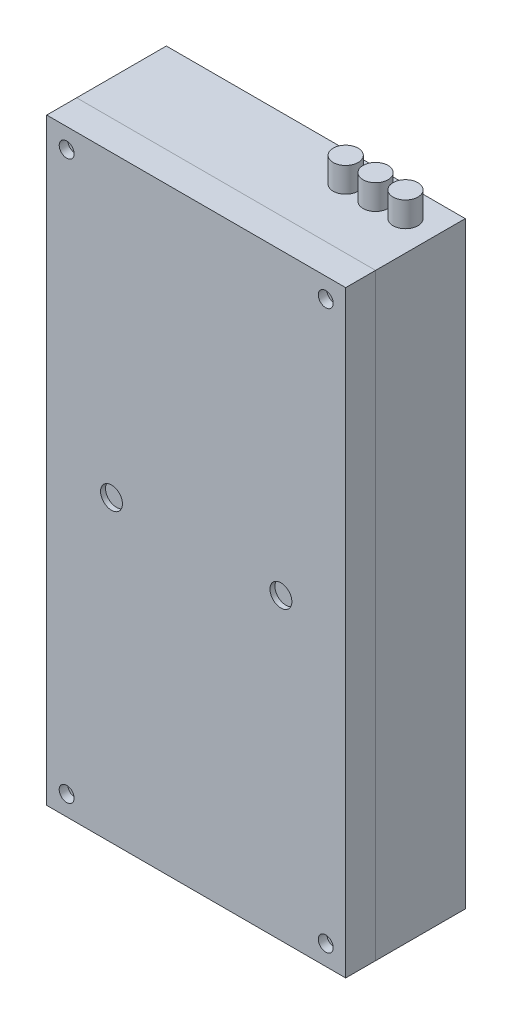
ISO-10303-21;
HEADER;
FILE_DESCRIPTION(('STEP AP214'),'2;1');
FILE_NAME('part.step','',(''),(''),'','','');
FILE_SCHEMA(('AUTOMOTIVE_DESIGN { 1 0 10303 214 1 1 1 1 }'));
ENDSEC;
DATA;
#1=APPLICATION_CONTEXT('core data for automotive mechanical design processes');
#2=APPLICATION_PROTOCOL_DEFINITION('international standard','automotive_design',2000,#1);
#3=PRODUCT_CONTEXT('',#1,'mechanical');
#4=PRODUCT('Part','Part','',(#3));
#5=PRODUCT_RELATED_PRODUCT_CATEGORY('part','',(#4));
#6=PRODUCT_DEFINITION_FORMATION('','',#4);
#7=PRODUCT_DEFINITION_CONTEXT('part definition',#1,'design');
#8=PRODUCT_DEFINITION('design','',#6,#7);
#9=PRODUCT_DEFINITION_SHAPE('','',#8);
#10=(LENGTH_UNIT() NAMED_UNIT(*) SI_UNIT(.MILLI.,.METRE.));
#11=(NAMED_UNIT(*) PLANE_ANGLE_UNIT() SI_UNIT($,.RADIAN.));
#12=(NAMED_UNIT(*) SI_UNIT($,.STERADIAN.) SOLID_ANGLE_UNIT());
#13=UNCERTAINTY_MEASURE_WITH_UNIT(LENGTH_MEASURE(1.E-05),#10,'distance_accuracy_value','');
#14=(GEOMETRIC_REPRESENTATION_CONTEXT(3) GLOBAL_UNCERTAINTY_ASSIGNED_CONTEXT((#13)) GLOBAL_UNIT_ASSIGNED_CONTEXT((#10,
#11,#12)) REPRESENTATION_CONTEXT('',''));
#15=CARTESIAN_POINT('',(0.,0.,0.));
#16=DIRECTION('',(0.,0.,1.));
#17=DIRECTION('',(1.,0.,0.));
#18=AXIS2_PLACEMENT_3D('',#15,#16,#17);
#19=CARTESIAN_POINT('',(90.,325.,30.));
#20=DIRECTION('',(0.,1.,0.));
#21=DIRECTION('',(0.,0.,1.));
#22=AXIS2_PLACEMENT_3D('',#19,#20,#21);
#23=PLANE('',#22);
#24=CARTESIAN_POINT('',(90.,325.,30.));
#25=DIRECTION('',(0.,-1.,0.));
#26=DIRECTION('',(0.,0.,-1.));
#27=AXIS2_PLACEMENT_3D('',#24,#25,#26);
#28=CIRCLE('',#27,12.5);
#29=CARTESIAN_POINT('',(90.,325.,17.5));
#30=VERTEX_POINT('',#29);
#31=EDGE_CURVE('P0_E19',#30,#30,#28,.T.);
#32=ORIENTED_EDGE('',*,*,#31,.F.);
#33=EDGE_LOOP('',(#32));
#34=FACE_BOUND('',#33,.T.);
#35=ADVANCED_FACE('P0_F16',(#34),#23,.T.);
#36=CARTESIAN_POINT('',(120.,325.,30.));
#37=DIRECTION('',(0.,1.,0.));
#38=DIRECTION('',(0.,0.,1.));
#39=AXIS2_PLACEMENT_3D('',#36,#37,#38);
#40=PLANE('',#39);
#41=CARTESIAN_POINT('',(120.,325.,30.));
#42=DIRECTION('',(0.,-1.,0.));
#43=DIRECTION('',(0.,0.,-1.));
#44=AXIS2_PLACEMENT_3D('',#41,#42,#43);
#45=CIRCLE('',#44,12.5);
#46=CARTESIAN_POINT('',(120.,325.,17.5));
#47=VERTEX_POINT('',#46);
#48=EDGE_CURVE('P0_E129',#47,#47,#45,.T.);
#49=ORIENTED_EDGE('',*,*,#48,.F.);
#50=EDGE_LOOP('',(#49));
#51=FACE_BOUND('',#50,.T.);
#52=ADVANCED_FACE('P0_F140',(#51),#40,.T.);
#53=CARTESIAN_POINT('',(60.,325.,30.));
#54=DIRECTION('',(0.,1.,0.));
#55=DIRECTION('',(0.,0.,1.));
#56=AXIS2_PLACEMENT_3D('',#53,#54,#55);
#57=PLANE('',#56);
#58=CARTESIAN_POINT('',(60.,325.,30.));
#59=DIRECTION('',(0.,-1.,0.));
#60=DIRECTION('',(0.,0.,-1.));
#61=AXIS2_PLACEMENT_3D('',#58,#59,#60);
#62=CIRCLE('',#61,12.5);
#63=CARTESIAN_POINT('',(60.,325.,17.5));
#64=VERTEX_POINT('',#63);
#65=EDGE_CURVE('P0_E121',#64,#64,#62,.T.);
#66=ORIENTED_EDGE('',*,*,#65,.F.);
#67=EDGE_LOOP('',(#66));
#68=FACE_BOUND('',#67,.T.);
#69=ADVANCED_FACE('P0_F145',(#68),#57,.T.);
#70=CARTESIAN_POINT('',(90.,325.,30.));
#71=DIRECTION('',(0.,-1.,0.));
#72=DIRECTION('',(0.,0.,-1.));
#73=AXIS2_PLACEMENT_3D('',#70,#71,#72);
#74=CYLINDRICAL_SURFACE('',#73,12.5);
#75=ORIENTED_EDGE('',*,*,#31,.T.);
#76=EDGE_LOOP('',(#75));
#77=FACE_BOUND('',#76,.T.);
#78=CARTESIAN_POINT('',(90.,300.,30.));
#79=DIRECTION('',(0.,-1.,0.));
#80=DIRECTION('',(0.,0.,-1.));
#81=AXIS2_PLACEMENT_3D('',#78,#79,#80);
#82=CIRCLE('',#81,12.5);
#83=CARTESIAN_POINT('',(90.,300.,17.5));
#84=VERTEX_POINT('',#83);
#85=EDGE_CURVE('P0_E102',#84,#84,#82,.F.);
#86=ORIENTED_EDGE('',*,*,#85,.T.);
#87=EDGE_LOOP('',(#86));
#88=FACE_BOUND('',#87,.T.);
#89=ADVANCED_FACE('P0_F136',(#77,#88),#74,.T.);
#90=CARTESIAN_POINT('',(120.,325.,30.));
#91=DIRECTION('',(0.,-1.,0.));
#92=DIRECTION('',(0.,0.,-1.));
#93=AXIS2_PLACEMENT_3D('',#90,#91,#92);
#94=CYLINDRICAL_SURFACE('',#93,12.5);
#95=ORIENTED_EDGE('',*,*,#48,.T.);
#96=EDGE_LOOP('',(#95));
#97=FACE_BOUND('',#96,.T.);
#98=CARTESIAN_POINT('',(120.,300.,30.));
#99=DIRECTION('',(0.,-1.,0.));
#100=DIRECTION('',(0.,0.,-1.));
#101=AXIS2_PLACEMENT_3D('',#98,#99,#100);
#102=CIRCLE('',#101,12.5);
#103=CARTESIAN_POINT('',(120.,300.,17.5));
#104=VERTEX_POINT('',#103);
#105=EDGE_CURVE('P0_E114',#104,#104,#102,.F.);
#106=ORIENTED_EDGE('',*,*,#105,.T.);
#107=EDGE_LOOP('',(#106));
#108=FACE_BOUND('',#107,.T.);
#109=ADVANCED_FACE('P0_F187',(#97,#108),#94,.T.);
#110=CARTESIAN_POINT('',(60.,325.,30.));
#111=DIRECTION('',(0.,-1.,0.));
#112=DIRECTION('',(0.,0.,-1.));
#113=AXIS2_PLACEMENT_3D('',#110,#111,#112);
#114=CYLINDRICAL_SURFACE('',#113,12.5);
#115=ORIENTED_EDGE('',*,*,#65,.T.);
#116=EDGE_LOOP('',(#115));
#117=FACE_BOUND('',#116,.T.);
#118=CARTESIAN_POINT('',(60.,300.,30.));
#119=DIRECTION('',(0.,-1.,0.));
#120=DIRECTION('',(0.,0.,-1.));
#121=AXIS2_PLACEMENT_3D('',#118,#119,#120);
#122=CIRCLE('',#121,12.5);
#123=CARTESIAN_POINT('',(60.,300.,17.5));
#124=VERTEX_POINT('',#123);
#125=EDGE_CURVE('P0_E92',#124,#124,#122,.F.);
#126=ORIENTED_EDGE('',*,*,#125,.T.);
#127=EDGE_LOOP('',(#126));
#128=FACE_BOUND('',#127,.T.);
#129=ADVANCED_FACE('P0_F183',(#117,#128),#114,.T.);
#130=CARTESIAN_POINT('',(-142.,292.,110.));
#131=DIRECTION('',(-1.,0.,0.));
#132=DIRECTION('',(0.,-1.,0.));
#133=AXIS2_PLACEMENT_3D('',#130,#131,#132);
#134=PLANE('',#133);
#135=DIRECTION('',(0.,0.,-1.));
#136=VECTOR('',#135,1.);
#137=CARTESIAN_POINT('',(-142.,-292.,110.));
#138=LINE('',#137,#136);
#139=CARTESIAN_POINT('',(-142.,-292.,90.));
#140=VERTEX_POINT('',#139);
#141=CARTESIAN_POINT('',(-142.,-292.,0.));
#142=VERTEX_POINT('',#141);
#143=EDGE_CURVE('P0_E103',#140,#142,#138,.T.);
#144=ORIENTED_EDGE('',*,*,#143,.T.);
#145=DIRECTION('',(0.,1.,0.));
#146=VECTOR('',#145,1.);
#147=CARTESIAN_POINT('',(-142.,-300.,0.));
#148=LINE('',#147,#146);
#149=CARTESIAN_POINT('',(-142.,292.,0.));
#150=VERTEX_POINT('',#149);
#151=EDGE_CURVE('P0_E229',#142,#150,#148,.T.);
#152=ORIENTED_EDGE('',*,*,#151,.T.);
#153=DIRECTION('',(0.,0.,1.));
#154=VECTOR('',#153,1.);
#155=CARTESIAN_POINT('',(-142.,292.,110.));
#156=LINE('',#155,#154);
#157=CARTESIAN_POINT('',(-142.,292.,90.));
#158=VERTEX_POINT('',#157);
#159=EDGE_CURVE('P0_E118',#150,#158,#156,.T.);
#160=ORIENTED_EDGE('',*,*,#159,.T.);
#161=DIRECTION('',(0.,1.,0.));
#162=VECTOR('',#161,1.);
#163=CARTESIAN_POINT('',(-142.,-300.,90.));
#164=LINE('',#163,#162);
#165=EDGE_CURVE('P0_E107',#140,#158,#164,.T.);
#166=ORIENTED_EDGE('',*,*,#165,.F.);
#167=EDGE_LOOP('',(#144,#152,#160,#166));
#168=FACE_BOUND('',#167,.T.);
#169=ADVANCED_FACE('P0_F180',(#168),#134,.F.);
#170=CARTESIAN_POINT('',(142.,292.,110.));
#171=DIRECTION('',(0.,1.,0.));
#172=DIRECTION('',(0.,0.,1.));
#173=AXIS2_PLACEMENT_3D('',#170,#171,#172);
#174=PLANE('',#173);
#175=ORIENTED_EDGE('',*,*,#159,.F.);
#176=DIRECTION('',(1.,0.,0.));
#177=VECTOR('',#176,1.);
#178=CARTESIAN_POINT('',(-150.,292.,0.));
#179=LINE('',#178,#177);
#180=CARTESIAN_POINT('',(142.,292.,0.));
#181=VERTEX_POINT('',#180);
#182=EDGE_CURVE('P0_E227',#150,#181,#179,.T.);
#183=ORIENTED_EDGE('',*,*,#182,.T.);
#184=DIRECTION('',(0.,0.,1.));
#185=VECTOR('',#184,1.);
#186=CARTESIAN_POINT('',(142.,292.,110.));
#187=LINE('',#186,#185);
#188=CARTESIAN_POINT('',(142.,292.,90.));
#189=VERTEX_POINT('',#188);
#190=EDGE_CURVE('P0_E78',#181,#189,#187,.T.);
#191=ORIENTED_EDGE('',*,*,#190,.T.);
#192=DIRECTION('',(1.,0.,0.));
#193=VECTOR('',#192,1.);
#194=CARTESIAN_POINT('',(-150.,292.,90.));
#195=LINE('',#194,#193);
#196=EDGE_CURVE('P0_E90',#158,#189,#195,.T.);
#197=ORIENTED_EDGE('',*,*,#196,.F.);
#198=EDGE_LOOP('',(#175,#183,#191,#197));
#199=FACE_BOUND('',#198,.T.);
#200=ADVANCED_FACE('P0_F177',(#199),#174,.F.);
#201=CARTESIAN_POINT('',(142.,292.,110.));
#202=DIRECTION('',(1.,0.,0.));
#203=DIRECTION('',(0.,1.,0.));
#204=AXIS2_PLACEMENT_3D('',#201,#202,#203);
#205=PLANE('',#204);
#206=ORIENTED_EDGE('',*,*,#190,.F.);
#207=DIRECTION('',(0.,1.,0.));
#208=VECTOR('',#207,1.);
#209=CARTESIAN_POINT('',(142.,-300.,0.));
#210=LINE('',#209,#208);
#211=CARTESIAN_POINT('',(142.,-292.,0.));
#212=VERTEX_POINT('',#211);
#213=EDGE_CURVE('P0_E98',#181,#212,#210,.F.);
#214=ORIENTED_EDGE('',*,*,#213,.T.);
#215=DIRECTION('',(0.,0.,-1.));
#216=VECTOR('',#215,1.);
#217=CARTESIAN_POINT('',(142.,-292.,110.));
#218=LINE('',#217,#216);
#219=CARTESIAN_POINT('',(142.,-292.,90.));
#220=VERTEX_POINT('',#219);
#221=EDGE_CURVE('P0_E95',#212,#220,#218,.F.);
#222=ORIENTED_EDGE('',*,*,#221,.T.);
#223=DIRECTION('',(0.,1.,0.));
#224=VECTOR('',#223,1.);
#225=CARTESIAN_POINT('',(142.,-300.,90.));
#226=LINE('',#225,#224);
#227=EDGE_CURVE('P0_E84',#189,#220,#226,.F.);
#228=ORIENTED_EDGE('',*,*,#227,.F.);
#229=EDGE_LOOP('',(#206,#214,#222,#228));
#230=FACE_BOUND('',#229,.T.);
#231=ADVANCED_FACE('P0_F96',(#230),#205,.F.);
#232=CARTESIAN_POINT('',(142.,-292.,110.));
#233=DIRECTION('',(0.,-1.,0.));
#234=DIRECTION('',(0.,0.,-1.));
#235=AXIS2_PLACEMENT_3D('',#232,#233,#234);
#236=PLANE('',#235);
#237=ORIENTED_EDGE('',*,*,#221,.F.);
#238=DIRECTION('',(1.,0.,0.));
#239=VECTOR('',#238,1.);
#240=CARTESIAN_POINT('',(-150.,-292.,0.));
#241=LINE('',#240,#239);
#242=EDGE_CURVE('P0_E224',#212,#142,#241,.F.);
#243=ORIENTED_EDGE('',*,*,#242,.T.);
#244=ORIENTED_EDGE('',*,*,#143,.F.);
#245=DIRECTION('',(1.,0.,0.));
#246=VECTOR('',#245,1.);
#247=CARTESIAN_POINT('',(-150.,-292.,90.));
#248=LINE('',#247,#246);
#249=EDGE_CURVE('P0_E88',#220,#140,#248,.F.);
#250=ORIENTED_EDGE('',*,*,#249,.F.);
#251=EDGE_LOOP('',(#237,#243,#244,#250));
#252=FACE_BOUND('',#251,.T.);
#253=ADVANCED_FACE('P0_F105',(#252),#236,.F.);
#254=CARTESIAN_POINT('',(150.,300.,90.));
#255=DIRECTION('',(-1.,0.,0.));
#256=DIRECTION('',(0.,-1.,0.));
#257=AXIS2_PLACEMENT_3D('',#254,#255,#256);
#258=PLANE('',#257);
#259=DIRECTION('',(0.,0.,-1.));
#260=VECTOR('',#259,1.);
#261=CARTESIAN_POINT('',(150.,300.,90.));
#262=LINE('',#261,#260);
#263=CARTESIAN_POINT('',(150.,300.,0.));
#264=VERTEX_POINT('',#263);
#265=CARTESIAN_POINT('',(150.,300.,90.));
#266=VERTEX_POINT('',#265);
#267=EDGE_CURVE('P0_E112',#264,#266,#262,.F.);
#268=ORIENTED_EDGE('',*,*,#267,.T.);
#269=DIRECTION('',(0.,1.,0.));
#270=VECTOR('',#269,1.);
#271=CARTESIAN_POINT('',(150.,-300.,90.));
#272=LINE('',#271,#270);
#273=CARTESIAN_POINT('',(150.,-300.,90.));
#274=VERTEX_POINT('',#273);
#275=EDGE_CURVE('P0_E238',#274,#266,#272,.T.);
#276=ORIENTED_EDGE('',*,*,#275,.F.);
#277=DIRECTION('',(0.,0.,1.));
#278=VECTOR('',#277,1.);
#279=CARTESIAN_POINT('',(150.,-300.,90.));
#280=LINE('',#279,#278);
#281=CARTESIAN_POINT('',(150.,-300.,0.));
#282=VERTEX_POINT('',#281);
#283=EDGE_CURVE('P0_E232',#274,#282,#280,.F.);
#284=ORIENTED_EDGE('',*,*,#283,.T.);
#285=DIRECTION('',(0.,1.,0.));
#286=VECTOR('',#285,1.);
#287=CARTESIAN_POINT('',(150.,-300.,0.));
#288=LINE('',#287,#286);
#289=EDGE_CURVE('P0_E217',#282,#264,#288,.T.);
#290=ORIENTED_EDGE('',*,*,#289,.T.);
#291=EDGE_LOOP('',(#268,#276,#284,#290));
#292=FACE_BOUND('',#291,.T.);
#293=ADVANCED_FACE('P0_F168',(#292),#258,.F.);
#294=CARTESIAN_POINT('',(-150.,300.,90.));
#295=DIRECTION('',(0.,-1.,0.));
#296=DIRECTION('',(0.,0.,-1.));
#297=AXIS2_PLACEMENT_3D('',#294,#295,#296);
#298=PLANE('',#297);
#299=ORIENTED_EDGE('',*,*,#125,.F.);
#300=EDGE_LOOP('',(#299));
#301=FACE_BOUND('',#300,.T.);
#302=ORIENTED_EDGE('',*,*,#105,.F.);
#303=EDGE_LOOP('',(#302));
#304=FACE_BOUND('',#303,.T.);
#305=DIRECTION('',(0.,0.,1.));
#306=VECTOR('',#305,1.);
#307=CARTESIAN_POINT('',(-150.,300.,90.));
#308=LINE('',#307,#306);
#309=CARTESIAN_POINT('',(-150.,300.,0.));
#310=VERTEX_POINT('',#309);
#311=CARTESIAN_POINT('',(-150.,300.,90.));
#312=VERTEX_POINT('',#311);
#313=EDGE_CURVE('P0_E207',#310,#312,#308,.T.);
#314=ORIENTED_EDGE('',*,*,#313,.T.);
#315=DIRECTION('',(1.,0.,0.));
#316=VECTOR('',#315,1.);
#317=CARTESIAN_POINT('',(-150.,300.,90.));
#318=LINE('',#317,#316);
#319=EDGE_CURVE('P0_E209',#266,#312,#318,.F.);
#320=ORIENTED_EDGE('',*,*,#319,.F.);
#321=ORIENTED_EDGE('',*,*,#267,.F.);
#322=DIRECTION('',(1.,0.,0.));
#323=VECTOR('',#322,1.);
#324=CARTESIAN_POINT('',(-150.,300.,0.));
#325=LINE('',#324,#323);
#326=EDGE_CURVE('P0_E211',#264,#310,#325,.F.);
#327=ORIENTED_EDGE('',*,*,#326,.T.);
#328=EDGE_LOOP('',(#314,#320,#321,#327));
#329=FACE_BOUND('',#328,.T.);
#330=ORIENTED_EDGE('',*,*,#85,.F.);
#331=EDGE_LOOP('',(#330));
#332=FACE_BOUND('',#331,.T.);
#333=ADVANCED_FACE('P0_F164',(#301,#304,#329,#332),#298,.F.);
#334=CARTESIAN_POINT('',(-150.,-300.,90.));
#335=DIRECTION('',(0.,0.,1.));
#336=DIRECTION('',(1.,0.,0.));
#337=AXIS2_PLACEMENT_3D('',#334,#335,#336);
#338=PLANE('',#337);
#339=ORIENTED_EDGE('',*,*,#275,.T.);
#340=ORIENTED_EDGE('',*,*,#319,.T.);
#341=DIRECTION('',(0.,1.,0.));
#342=VECTOR('',#341,1.);
#343=CARTESIAN_POINT('',(-150.,300.,90.));
#344=LINE('',#343,#342);
#345=CARTESIAN_POINT('',(-150.,-300.,90.));
#346=VERTEX_POINT('',#345);
#347=EDGE_CURVE('P0_E213',#312,#346,#344,.F.);
#348=ORIENTED_EDGE('',*,*,#347,.T.);
#349=DIRECTION('',(1.,0.,0.));
#350=VECTOR('',#349,1.);
#351=CARTESIAN_POINT('',(-150.,-300.,90.));
#352=LINE('',#351,#350);
#353=EDGE_CURVE('P0_E234',#346,#274,#352,.T.);
#354=ORIENTED_EDGE('',*,*,#353,.T.);
#355=EDGE_LOOP('',(#339,#340,#348,#354));
#356=FACE_BOUND('',#355,.T.);
#357=ORIENTED_EDGE('',*,*,#165,.T.);
#358=ORIENTED_EDGE('',*,*,#196,.T.);
#359=ORIENTED_EDGE('',*,*,#227,.T.);
#360=ORIENTED_EDGE('',*,*,#249,.T.);
#361=EDGE_LOOP('',(#357,#358,#359,#360));
#362=FACE_BOUND('',#361,.T.);
#363=ADVANCED_FACE('P0_F86',(#356,#362),#338,.T.);
#364=CARTESIAN_POINT('',(-150.,-300.,90.));
#365=DIRECTION('',(0.,1.,0.));
#366=DIRECTION('',(0.,0.,1.));
#367=AXIS2_PLACEMENT_3D('',#364,#365,#366);
#368=PLANE('',#367);
#369=ORIENTED_EDGE('',*,*,#283,.F.);
#370=ORIENTED_EDGE('',*,*,#353,.F.);
#371=DIRECTION('',(0.,0.,1.));
#372=VECTOR('',#371,1.);
#373=CARTESIAN_POINT('',(-150.,-300.,90.));
#374=LINE('',#373,#372);
#375=CARTESIAN_POINT('',(-150.,-300.,0.));
#376=VERTEX_POINT('',#375);
#377=EDGE_CURVE('P0_E25',#346,#376,#374,.F.);
#378=ORIENTED_EDGE('',*,*,#377,.T.);
#379=DIRECTION('',(1.,0.,0.));
#380=VECTOR('',#379,1.);
#381=CARTESIAN_POINT('',(-150.,-300.,0.));
#382=LINE('',#381,#380);
#383=EDGE_CURVE('P0_E33',#376,#282,#382,.T.);
#384=ORIENTED_EDGE('',*,*,#383,.T.);
#385=EDGE_LOOP('',(#369,#370,#378,#384));
#386=FACE_BOUND('',#385,.T.);
#387=ADVANCED_FACE('P0_F155',(#386),#368,.F.);
#388=CARTESIAN_POINT('',(-150.,-300.,0.));
#389=DIRECTION('',(0.,0.,1.));
#390=DIRECTION('',(1.,0.,0.));
#391=AXIS2_PLACEMENT_3D('',#388,#389,#390);
#392=PLANE('',#391);
#393=ORIENTED_EDGE('',*,*,#326,.F.);
#394=ORIENTED_EDGE('',*,*,#289,.F.);
#395=ORIENTED_EDGE('',*,*,#383,.F.);
#396=DIRECTION('',(0.,1.,0.));
#397=VECTOR('',#396,1.);
#398=CARTESIAN_POINT('',(-150.,300.,0.));
#399=LINE('',#398,#397);
#400=EDGE_CURVE('P0_E11',#376,#310,#399,.T.);
#401=ORIENTED_EDGE('',*,*,#400,.T.);
#402=EDGE_LOOP('',(#393,#394,#395,#401));
#403=FACE_BOUND('',#402,.T.);
#404=ORIENTED_EDGE('',*,*,#213,.F.);
#405=ORIENTED_EDGE('',*,*,#182,.F.);
#406=ORIENTED_EDGE('',*,*,#151,.F.);
#407=ORIENTED_EDGE('',*,*,#242,.F.);
#408=EDGE_LOOP('',(#404,#405,#406,#407));
#409=FACE_BOUND('',#408,.T.);
#410=ADVANCED_FACE('P0_F149',(#403,#409),#392,.F.);
#411=CARTESIAN_POINT('',(-150.,300.,90.));
#412=DIRECTION('',(1.,0.,0.));
#413=DIRECTION('',(0.,1.,0.));
#414=AXIS2_PLACEMENT_3D('',#411,#412,#413);
#415=PLANE('',#414);
#416=ORIENTED_EDGE('',*,*,#377,.F.);
#417=ORIENTED_EDGE('',*,*,#347,.F.);
#418=ORIENTED_EDGE('',*,*,#313,.F.);
#419=ORIENTED_EDGE('',*,*,#400,.F.);
#420=EDGE_LOOP('',(#416,#417,#418,#419));
#421=FACE_BOUND('',#420,.T.);
#422=ADVANCED_FACE('P0_F147',(#421),#415,.F.);
#423=CLOSED_SHELL('',(#35,#52,#69,#89,#109,#129,#169,#200,#231,#253,#293,#333,#363,#387,#410,#422));
#424=MANIFOLD_SOLID_BREP('P0_B1',#423);
#425=CARTESIAN_POINT('',(142.,-292.,110.));
#426=DIRECTION('',(0.,0.,-1.));
#427=DIRECTION('',(-1.,0.,0.));
#428=AXIS2_PLACEMENT_3D('',#425,#426,#427);
#429=PLANE('',#428);
#430=CARTESIAN_POINT('',(130.,-280.,110.));
#431=DIRECTION('',(0.,0.,1.));
#432=DIRECTION('',(1.,0.,0.));
#433=AXIS2_PLACEMENT_3D('',#430,#431,#432);
#434=CIRCLE('',#433,4.5);
#435=CARTESIAN_POINT('',(134.5,-280.,110.));
#436=VERTEX_POINT('',#435);
#437=EDGE_CURVE('P1_E89',#436,#436,#434,.T.);
#438=ORIENTED_EDGE('',*,*,#437,.T.);
#439=EDGE_LOOP('',(#438));
#440=FACE_BOUND('',#439,.T.);
#441=CARTESIAN_POINT('',(-130.,280.,110.));
#442=DIRECTION('',(0.,0.,1.));
#443=DIRECTION('',(1.,0.,0.));
#444=AXIS2_PLACEMENT_3D('',#441,#442,#443);
#445=CIRCLE('',#444,4.5);
#446=CARTESIAN_POINT('',(-125.5,280.,110.));
#447=VERTEX_POINT('',#446);
#448=EDGE_CURVE('P1_E164',#447,#447,#445,.T.);
#449=ORIENTED_EDGE('',*,*,#448,.T.);
#450=EDGE_LOOP('',(#449));
#451=FACE_BOUND('',#450,.T.);
#452=DIRECTION('',(0.,-1.,0.));
#453=VECTOR('',#452,1.);
#454=CARTESIAN_POINT('',(-142.,292.,110.));
#455=LINE('',#454,#453);
#456=CARTESIAN_POINT('',(-142.,-292.,110.));
#457=VERTEX_POINT('',#456);
#458=CARTESIAN_POINT('',(-142.,292.,110.));
#459=VERTEX_POINT('',#458);
#460=EDGE_CURVE('P1_E81',#457,#459,#455,.F.);
#461=ORIENTED_EDGE('',*,*,#460,.T.);
#462=DIRECTION('',(1.,0.,0.));
#463=VECTOR('',#462,1.);
#464=CARTESIAN_POINT('',(142.,292.,110.));
#465=LINE('',#464,#463);
#466=CARTESIAN_POINT('',(142.,292.,110.));
#467=VERTEX_POINT('',#466);
#468=EDGE_CURVE('P1_E78',#459,#467,#465,.T.);
#469=ORIENTED_EDGE('',*,*,#468,.T.);
#470=DIRECTION('',(0.,1.,0.));
#471=VECTOR('',#470,1.);
#472=CARTESIAN_POINT('',(142.,292.,110.));
#473=LINE('',#472,#471);
#474=CARTESIAN_POINT('',(142.,-292.,110.));
#475=VERTEX_POINT('',#474);
#476=EDGE_CURVE('P1_E103',#467,#475,#473,.F.);
#477=ORIENTED_EDGE('',*,*,#476,.T.);
#478=DIRECTION('',(1.,0.,0.));
#479=VECTOR('',#478,1.);
#480=CARTESIAN_POINT('',(142.,-292.,110.));
#481=LINE('',#480,#479);
#482=EDGE_CURVE('P1_E85',#475,#457,#481,.F.);
#483=ORIENTED_EDGE('',*,*,#482,.T.);
#484=EDGE_LOOP('',(#461,#469,#477,#483));
#485=FACE_BOUND('',#484,.T.);
#486=CARTESIAN_POINT('',(130.,280.,110.));
#487=DIRECTION('',(0.,0.,1.));
#488=DIRECTION('',(1.,0.,0.));
#489=AXIS2_PLACEMENT_3D('',#486,#487,#488);
#490=CIRCLE('',#489,4.5);
#491=CARTESIAN_POINT('',(134.5,280.,110.));
#492=VERTEX_POINT('',#491);
#493=EDGE_CURVE('P1_E19',#492,#492,#490,.T.);
#494=ORIENTED_EDGE('',*,*,#493,.T.);
#495=EDGE_LOOP('',(#494));
#496=FACE_BOUND('',#495,.T.);
#497=CARTESIAN_POINT('',(-130.,-280.,110.));
#498=DIRECTION('',(0.,0.,1.));
#499=DIRECTION('',(1.,0.,0.));
#500=AXIS2_PLACEMENT_3D('',#497,#498,#499);
#501=CIRCLE('',#500,4.5);
#502=CARTESIAN_POINT('',(-125.5,-280.,110.));
#503=VERTEX_POINT('',#502);
#504=EDGE_CURVE('P1_E162',#503,#503,#501,.T.);
#505=ORIENTED_EDGE('',*,*,#504,.T.);
#506=EDGE_LOOP('',(#505));
#507=FACE_BOUND('',#506,.T.);
#508=ADVANCED_FACE('P1_F16',(#440,#451,#485,#496,#507),#429,.T.);
#509=CARTESIAN_POINT('',(130.,280.,120.));
#510=DIRECTION('',(0.,0.,1.));
#511=DIRECTION('',(1.,0.,0.));
#512=AXIS2_PLACEMENT_3D('',#509,#510,#511);
#513=CYLINDRICAL_SURFACE('',#512,4.5);
#514=ORIENTED_EDGE('',*,*,#493,.F.);
#515=EDGE_LOOP('',(#514));
#516=FACE_BOUND('',#515,.T.);
#517=CARTESIAN_POINT('',(130.,280.,111.4));
#518=DIRECTION('',(0.,0.,1.));
#519=DIRECTION('',(1.,0.,0.));
#520=AXIS2_PLACEMENT_3D('',#517,#518,#519);
#521=CIRCLE('',#520,4.5);
#522=CARTESIAN_POINT('',(134.5,280.,111.4));
#523=VERTEX_POINT('',#522);
#524=EDGE_CURVE('P1_E156',#523,#523,#521,.T.);
#525=ORIENTED_EDGE('',*,*,#524,.T.);
#526=EDGE_LOOP('',(#525));
#527=FACE_BOUND('',#526,.T.);
#528=ADVANCED_FACE('P1_F172',(#516,#527),#513,.F.);
#529=CARTESIAN_POINT('',(-130.,280.,120.));
#530=DIRECTION('',(0.,0.,1.));
#531=DIRECTION('',(1.,0.,0.));
#532=AXIS2_PLACEMENT_3D('',#529,#530,#531);
#533=CYLINDRICAL_SURFACE('',#532,4.5);
#534=ORIENTED_EDGE('',*,*,#448,.F.);
#535=EDGE_LOOP('',(#534));
#536=FACE_BOUND('',#535,.T.);
#537=CARTESIAN_POINT('',(-130.,280.,111.4));
#538=DIRECTION('',(0.,0.,1.));
#539=DIRECTION('',(1.,0.,0.));
#540=AXIS2_PLACEMENT_3D('',#537,#538,#539);
#541=CIRCLE('',#540,4.5);
#542=CARTESIAN_POINT('',(-125.5,280.,111.4));
#543=VERTEX_POINT('',#542);
#544=EDGE_CURVE('P1_E153',#543,#543,#541,.T.);
#545=ORIENTED_EDGE('',*,*,#544,.T.);
#546=EDGE_LOOP('',(#545));
#547=FACE_BOUND('',#546,.T.);
#548=ADVANCED_FACE('P1_F175',(#536,#547),#533,.F.);
#549=CARTESIAN_POINT('',(-130.,-280.,120.));
#550=DIRECTION('',(0.,0.,1.));
#551=DIRECTION('',(1.,0.,0.));
#552=AXIS2_PLACEMENT_3D('',#549,#550,#551);
#553=CYLINDRICAL_SURFACE('',#552,4.5);
#554=ORIENTED_EDGE('',*,*,#504,.F.);
#555=EDGE_LOOP('',(#554));
#556=FACE_BOUND('',#555,.T.);
#557=CARTESIAN_POINT('',(-130.,-280.,111.4));
#558=DIRECTION('',(0.,0.,1.));
#559=DIRECTION('',(1.,0.,0.));
#560=AXIS2_PLACEMENT_3D('',#557,#558,#559);
#561=CIRCLE('',#560,4.5);
#562=CARTESIAN_POINT('',(-125.5,-280.,111.4));
#563=VERTEX_POINT('',#562);
#564=EDGE_CURVE('P1_E150',#563,#563,#561,.T.);
#565=ORIENTED_EDGE('',*,*,#564,.T.);
#566=EDGE_LOOP('',(#565));
#567=FACE_BOUND('',#566,.T.);
#568=ADVANCED_FACE('P1_F259',(#556,#567),#553,.F.);
#569=CARTESIAN_POINT('',(130.,-280.,120.));
#570=DIRECTION('',(0.,0.,1.));
#571=DIRECTION('',(1.,0.,0.));
#572=AXIS2_PLACEMENT_3D('',#569,#570,#571);
#573=CYLINDRICAL_SURFACE('',#572,4.5);
#574=ORIENTED_EDGE('',*,*,#437,.F.);
#575=EDGE_LOOP('',(#574));
#576=FACE_BOUND('',#575,.T.);
#577=CARTESIAN_POINT('',(130.,-280.,111.4));
#578=DIRECTION('',(0.,0.,1.));
#579=DIRECTION('',(1.,0.,0.));
#580=AXIS2_PLACEMENT_3D('',#577,#578,#579);
#581=CIRCLE('',#580,4.5);
#582=CARTESIAN_POINT('',(134.5,-280.,111.4));
#583=VERTEX_POINT('',#582);
#584=EDGE_CURVE('P1_E147',#583,#583,#581,.T.);
#585=ORIENTED_EDGE('',*,*,#584,.T.);
#586=EDGE_LOOP('',(#585));
#587=FACE_BOUND('',#586,.T.);
#588=ADVANCED_FACE('P1_F261',(#576,#587),#573,.F.);
#589=CARTESIAN_POINT('',(-142.,292.,110.));
#590=DIRECTION('',(-1.,0.,0.));
#591=DIRECTION('',(0.,-1.,0.));
#592=AXIS2_PLACEMENT_3D('',#589,#590,#591);
#593=PLANE('',#592);
#594=ORIENTED_EDGE('',*,*,#460,.F.);
#595=DIRECTION('',(0.,0.,-1.));
#596=VECTOR('',#595,1.);
#597=CARTESIAN_POINT('',(-142.,-292.,110.));
#598=LINE('',#597,#596);
#599=CARTESIAN_POINT('',(-142.,-292.,90.));
#600=VERTEX_POINT('',#599);
#601=EDGE_CURVE('P1_E159',#457,#600,#598,.T.);
#602=ORIENTED_EDGE('',*,*,#601,.T.);
#603=DIRECTION('',(0.,1.,0.));
#604=VECTOR('',#603,1.);
#605=CARTESIAN_POINT('',(-142.,-300.,90.));
#606=LINE('',#605,#604);
#607=CARTESIAN_POINT('',(-142.,292.,90.));
#608=VERTEX_POINT('',#607);
#609=EDGE_CURVE('P1_E94',#600,#608,#606,.T.);
#610=ORIENTED_EDGE('',*,*,#609,.T.);
#611=DIRECTION('',(0.,0.,1.));
#612=VECTOR('',#611,1.);
#613=CARTESIAN_POINT('',(-142.,292.,110.));
#614=LINE('',#613,#612);
#615=EDGE_CURVE('P1_E88',#608,#459,#614,.T.);
#616=ORIENTED_EDGE('',*,*,#615,.T.);
#617=EDGE_LOOP('',(#594,#602,#610,#616));
#618=FACE_BOUND('',#617,.T.);
#619=ADVANCED_FACE('P1_F92',(#618),#593,.F.);
#620=CARTESIAN_POINT('',(142.,292.,110.));
#621=DIRECTION('',(0.,1.,0.));
#622=DIRECTION('',(0.,0.,1.));
#623=AXIS2_PLACEMENT_3D('',#620,#621,#622);
#624=PLANE('',#623);
#625=ORIENTED_EDGE('',*,*,#468,.F.);
#626=ORIENTED_EDGE('',*,*,#615,.F.);
#627=DIRECTION('',(1.,0.,0.));
#628=VECTOR('',#627,1.);
#629=CARTESIAN_POINT('',(-150.,292.,90.));
#630=LINE('',#629,#628);
#631=CARTESIAN_POINT('',(142.,292.,90.));
#632=VERTEX_POINT('',#631);
#633=EDGE_CURVE('P1_E469',#608,#632,#630,.T.);
#634=ORIENTED_EDGE('',*,*,#633,.T.);
#635=DIRECTION('',(0.,0.,1.));
#636=VECTOR('',#635,1.);
#637=CARTESIAN_POINT('',(142.,292.,110.));
#638=LINE('',#637,#636);
#639=EDGE_CURVE('P1_E100',#632,#467,#638,.T.);
#640=ORIENTED_EDGE('',*,*,#639,.T.);
#641=EDGE_LOOP('',(#625,#626,#634,#640));
#642=FACE_BOUND('',#641,.T.);
#643=ADVANCED_FACE('P1_F98',(#642),#624,.F.);
#644=CARTESIAN_POINT('',(142.,292.,110.));
#645=DIRECTION('',(1.,0.,0.));
#646=DIRECTION('',(0.,1.,0.));
#647=AXIS2_PLACEMENT_3D('',#644,#645,#646);
#648=PLANE('',#647);
#649=ORIENTED_EDGE('',*,*,#476,.F.);
#650=ORIENTED_EDGE('',*,*,#639,.F.);
#651=DIRECTION('',(0.,1.,0.));
#652=VECTOR('',#651,1.);
#653=CARTESIAN_POINT('',(142.,-300.,90.));
#654=LINE('',#653,#652);
#655=CARTESIAN_POINT('',(142.,-292.,90.));
#656=VERTEX_POINT('',#655);
#657=EDGE_CURVE('P1_E467',#632,#656,#654,.F.);
#658=ORIENTED_EDGE('',*,*,#657,.T.);
#659=DIRECTION('',(0.,0.,-1.));
#660=VECTOR('',#659,1.);
#661=CARTESIAN_POINT('',(142.,-292.,110.));
#662=LINE('',#661,#660);
#663=EDGE_CURVE('P1_E460',#656,#475,#662,.F.);
#664=ORIENTED_EDGE('',*,*,#663,.T.);
#665=EDGE_LOOP('',(#649,#650,#658,#664));
#666=FACE_BOUND('',#665,.T.);
#667=ADVANCED_FACE('P1_F278',(#666),#648,.F.);
#668=CARTESIAN_POINT('',(142.,-292.,110.));
#669=DIRECTION('',(0.,-1.,0.));
#670=DIRECTION('',(0.,0.,-1.));
#671=AXIS2_PLACEMENT_3D('',#668,#669,#670);
#672=PLANE('',#671);
#673=ORIENTED_EDGE('',*,*,#482,.F.);
#674=ORIENTED_EDGE('',*,*,#663,.F.);
#675=DIRECTION('',(1.,0.,0.));
#676=VECTOR('',#675,1.);
#677=CARTESIAN_POINT('',(-150.,-292.,90.));
#678=LINE('',#677,#676);
#679=EDGE_CURVE('P1_E146',#656,#600,#678,.F.);
#680=ORIENTED_EDGE('',*,*,#679,.T.);
#681=ORIENTED_EDGE('',*,*,#601,.F.);
#682=EDGE_LOOP('',(#673,#674,#680,#681));
#683=FACE_BOUND('',#682,.T.);
#684=ADVANCED_FACE('P1_F281',(#683),#672,.F.);
#685=CARTESIAN_POINT('',(85.,0.,115.));
#686=DIRECTION('',(0.,0.,-1.));
#687=DIRECTION('',(-1.,0.,0.));
#688=AXIS2_PLACEMENT_3D('',#685,#686,#687);
#689=PLANE('',#688);
#690=CARTESIAN_POINT('',(85.,0.,115.));
#691=DIRECTION('',(0.,0.,1.));
#692=DIRECTION('',(1.,0.,0.));
#693=AXIS2_PLACEMENT_3D('',#690,#691,#692);
#694=CIRCLE('',#693,11.);
#695=CARTESIAN_POINT('',(96.,0.,115.));
#696=VERTEX_POINT('',#695);
#697=EDGE_CURVE('P1_E143',#696,#696,#694,.T.);
#698=ORIENTED_EDGE('',*,*,#697,.T.);
#699=EDGE_LOOP('',(#698));
#700=FACE_BOUND('',#699,.T.);
#701=ADVANCED_FACE('P1_F192',(#700),#689,.F.);
#702=CARTESIAN_POINT('',(-85.,0.,115.));
#703=DIRECTION('',(0.,0.,1.));
#704=DIRECTION('',(1.,0.,0.));
#705=AXIS2_PLACEMENT_3D('',#702,#703,#704);
#706=PLANE('',#705);
#707=CARTESIAN_POINT('',(-85.,0.,115.));
#708=DIRECTION('',(0.,0.,1.));
#709=DIRECTION('',(1.,0.,0.));
#710=AXIS2_PLACEMENT_3D('',#707,#708,#709);
#711=CIRCLE('',#710,11.);
#712=CARTESIAN_POINT('',(-74.,0.,115.));
#713=VERTEX_POINT('',#712);
#714=EDGE_CURVE('P1_E140',#713,#713,#711,.T.);
#715=ORIENTED_EDGE('',*,*,#714,.T.);
#716=EDGE_LOOP('',(#715));
#717=FACE_BOUND('',#716,.T.);
#718=ADVANCED_FACE('P1_F181',(#717),#706,.T.);
#719=CARTESIAN_POINT('',(134.5,280.,111.4));
#720=DIRECTION('',(0.,0.,-1.));
#721=DIRECTION('',(-1.,0.,0.));
#722=AXIS2_PLACEMENT_3D('',#719,#720,#721);
#723=PLANE('',#722);
#724=CARTESIAN_POINT('',(130.,280.,111.4));
#725=DIRECTION('',(0.,0.,1.));
#726=DIRECTION('',(1.,0.,0.));
#727=AXIS2_PLACEMENT_3D('',#724,#725,#726);
#728=CIRCLE('',#727,7.50000000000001);
#729=CARTESIAN_POINT('',(137.5,280.,111.4));
#730=VERTEX_POINT('',#729);
#731=EDGE_CURVE('P1_E137',#730,#730,#728,.T.);
#732=ORIENTED_EDGE('',*,*,#731,.T.);
#733=EDGE_LOOP('',(#732));
#734=FACE_BOUND('',#733,.T.);
#735=ORIENTED_EDGE('',*,*,#524,.F.);
#736=EDGE_LOOP('',(#735));
#737=FACE_BOUND('',#736,.T.);
#738=ADVANCED_FACE('P1_F178',(#734,#737),#723,.F.);
#739=CARTESIAN_POINT('',(-125.5,280.,111.4));
#740=DIRECTION('',(0.,0.,-1.));
#741=DIRECTION('',(-1.,0.,0.));
#742=AXIS2_PLACEMENT_3D('',#739,#740,#741);
#743=PLANE('',#742);
#744=CARTESIAN_POINT('',(-130.,280.,111.4));
#745=DIRECTION('',(0.,0.,1.));
#746=DIRECTION('',(1.,0.,0.));
#747=AXIS2_PLACEMENT_3D('',#744,#745,#746);
#748=CIRCLE('',#747,7.50000000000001);
#749=CARTESIAN_POINT('',(-122.5,280.,111.4));
#750=VERTEX_POINT('',#749);
#751=EDGE_CURVE('P1_E134',#750,#750,#748,.T.);
#752=ORIENTED_EDGE('',*,*,#751,.T.);
#753=EDGE_LOOP('',(#752));
#754=FACE_BOUND('',#753,.T.);
#755=ORIENTED_EDGE('',*,*,#544,.F.);
#756=EDGE_LOOP('',(#755));
#757=FACE_BOUND('',#756,.T.);
#758=ADVANCED_FACE('P1_F180',(#754,#757),#743,.F.);
#759=CARTESIAN_POINT('',(-125.5,-280.,111.4));
#760=DIRECTION('',(0.,0.,-1.));
#761=DIRECTION('',(-1.,0.,0.));
#762=AXIS2_PLACEMENT_3D('',#759,#760,#761);
#763=PLANE('',#762);
#764=CARTESIAN_POINT('',(-130.,-280.,111.4));
#765=DIRECTION('',(0.,0.,1.));
#766=DIRECTION('',(1.,0.,0.));
#767=AXIS2_PLACEMENT_3D('',#764,#765,#766);
#768=CIRCLE('',#767,7.50000000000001);
#769=CARTESIAN_POINT('',(-122.5,-280.,111.4));
#770=VERTEX_POINT('',#769);
#771=EDGE_CURVE('P1_E131',#770,#770,#768,.T.);
#772=ORIENTED_EDGE('',*,*,#771,.T.);
#773=EDGE_LOOP('',(#772));
#774=FACE_BOUND('',#773,.T.);
#775=ORIENTED_EDGE('',*,*,#564,.F.);
#776=EDGE_LOOP('',(#775));
#777=FACE_BOUND('',#776,.T.);
#778=ADVANCED_FACE('P1_F189',(#774,#777),#763,.F.);
#779=CARTESIAN_POINT('',(134.5,-280.,111.4));
#780=DIRECTION('',(0.,0.,-1.));
#781=DIRECTION('',(-1.,0.,0.));
#782=AXIS2_PLACEMENT_3D('',#779,#780,#781);
#783=PLANE('',#782);
#784=CARTESIAN_POINT('',(130.,-280.,111.4));
#785=DIRECTION('',(0.,0.,1.));
#786=DIRECTION('',(1.,0.,0.));
#787=AXIS2_PLACEMENT_3D('',#784,#785,#786);
#788=CIRCLE('',#787,7.50000000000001);
#789=CARTESIAN_POINT('',(137.5,-280.,111.4));
#790=VERTEX_POINT('',#789);
#791=EDGE_CURVE('P1_E127',#790,#790,#788,.T.);
#792=ORIENTED_EDGE('',*,*,#791,.T.);
#793=EDGE_LOOP('',(#792));
#794=FACE_BOUND('',#793,.T.);
#795=ORIENTED_EDGE('',*,*,#584,.F.);
#796=EDGE_LOOP('',(#795));
#797=FACE_BOUND('',#796,.T.);
#798=ADVANCED_FACE('P1_F246',(#794,#797),#783,.F.);
#799=CARTESIAN_POINT('',(-150.,-300.,90.));
#800=DIRECTION('',(0.,0.,1.));
#801=DIRECTION('',(1.,0.,0.));
#802=AXIS2_PLACEMENT_3D('',#799,#800,#801);
#803=PLANE('',#802);
#804=DIRECTION('',(1.,0.,0.));
#805=VECTOR('',#804,1.);
#806=CARTESIAN_POINT('',(-150.,300.,90.));
#807=LINE('',#806,#805);
#808=CARTESIAN_POINT('',(-150.,300.,90.));
#809=VERTEX_POINT('',#808);
#810=CARTESIAN_POINT('',(150.,300.,90.));
#811=VERTEX_POINT('',#810);
#812=EDGE_CURVE('P1_E126',#809,#811,#807,.T.);
#813=ORIENTED_EDGE('',*,*,#812,.T.);
#814=DIRECTION('',(0.,-1.,0.));
#815=VECTOR('',#814,1.);
#816=CARTESIAN_POINT('',(150.,300.,90.));
#817=LINE('',#816,#815);
#818=CARTESIAN_POINT('',(150.,-300.,90.));
#819=VERTEX_POINT('',#818);
#820=EDGE_CURVE('P1_E482',#811,#819,#817,.T.);
#821=ORIENTED_EDGE('',*,*,#820,.T.);
#822=DIRECTION('',(1.,0.,0.));
#823=VECTOR('',#822,1.);
#824=CARTESIAN_POINT('',(-150.,-300.,90.));
#825=LINE('',#824,#823);
#826=CARTESIAN_POINT('',(-150.,-300.,90.));
#827=VERTEX_POINT('',#826);
#828=EDGE_CURVE('P1_E477',#819,#827,#825,.F.);
#829=ORIENTED_EDGE('',*,*,#828,.T.);
#830=DIRECTION('',(0.,1.,0.));
#831=VECTOR('',#830,1.);
#832=CARTESIAN_POINT('',(-150.,300.,90.));
#833=LINE('',#832,#831);
#834=EDGE_CURVE('P1_E130',#827,#809,#833,.T.);
#835=ORIENTED_EDGE('',*,*,#834,.T.);
#836=EDGE_LOOP('',(#813,#821,#829,#835));
#837=FACE_BOUND('',#836,.T.);
#838=ORIENTED_EDGE('',*,*,#657,.F.);
#839=ORIENTED_EDGE('',*,*,#633,.F.);
#840=ORIENTED_EDGE('',*,*,#609,.F.);
#841=ORIENTED_EDGE('',*,*,#679,.F.);
#842=EDGE_LOOP('',(#838,#839,#840,#841));
#843=FACE_BOUND('',#842,.T.);
#844=ADVANCED_FACE('P1_F242',(#837,#843),#803,.F.);
#845=CARTESIAN_POINT('',(85.,0.,115.));
#846=DIRECTION('',(0.,0.,1.));
#847=DIRECTION('',(1.,0.,0.));
#848=AXIS2_PLACEMENT_3D('',#845,#846,#847);
#849=CYLINDRICAL_SURFACE('',#848,11.);
#850=CARTESIAN_POINT('',(85.,0.,120.));
#851=DIRECTION('',(0.,0.,1.));
#852=DIRECTION('',(1.,0.,0.));
#853=AXIS2_PLACEMENT_3D('',#850,#851,#852);
#854=CIRCLE('',#853,11.);
#855=CARTESIAN_POINT('',(96.,0.,120.));
#856=VERTEX_POINT('',#855);
#857=EDGE_CURVE('P1_E123',#856,#856,#854,.F.);
#858=ORIENTED_EDGE('',*,*,#857,.F.);
#859=EDGE_LOOP('',(#858));
#860=FACE_BOUND('',#859,.T.);
#861=ORIENTED_EDGE('',*,*,#697,.F.);
#862=EDGE_LOOP('',(#861));
#863=FACE_BOUND('',#862,.T.);
#864=ADVANCED_FACE('P1_F238',(#860,#863),#849,.F.);
#865=CARTESIAN_POINT('',(-85.,0.,115.));
#866=DIRECTION('',(0.,0.,1.));
#867=DIRECTION('',(1.,0.,0.));
#868=AXIS2_PLACEMENT_3D('',#865,#866,#867);
#869=CYLINDRICAL_SURFACE('',#868,11.);
#870=CARTESIAN_POINT('',(-85.,0.,120.));
#871=DIRECTION('',(0.,0.,1.));
#872=DIRECTION('',(1.,0.,0.));
#873=AXIS2_PLACEMENT_3D('',#870,#871,#872);
#874=CIRCLE('',#873,11.);
#875=CARTESIAN_POINT('',(-74.,0.,120.));
#876=VERTEX_POINT('',#875);
#877=EDGE_CURVE('P1_E120',#876,#876,#874,.F.);
#878=ORIENTED_EDGE('',*,*,#877,.F.);
#879=EDGE_LOOP('',(#878));
#880=FACE_BOUND('',#879,.T.);
#881=ORIENTED_EDGE('',*,*,#714,.F.);
#882=EDGE_LOOP('',(#881));
#883=FACE_BOUND('',#882,.T.);
#884=ADVANCED_FACE('P1_F234',(#880,#883),#869,.F.);
#885=CARTESIAN_POINT('',(130.,280.,120.));
#886=DIRECTION('',(0.,0.,1.));
#887=DIRECTION('',(1.,0.,0.));
#888=AXIS2_PLACEMENT_3D('',#885,#886,#887);
#889=CYLINDRICAL_SURFACE('',#888,7.50000000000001);
#890=CARTESIAN_POINT('',(130.,280.,120.));
#891=DIRECTION('',(0.,0.,1.));
#892=DIRECTION('',(1.,0.,0.));
#893=AXIS2_PLACEMENT_3D('',#890,#891,#892);
#894=CIRCLE('',#893,7.50000000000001);
#895=CARTESIAN_POINT('',(137.5,280.,120.));
#896=VERTEX_POINT('',#895);
#897=EDGE_CURVE('P1_E117',#896,#896,#894,.F.);
#898=ORIENTED_EDGE('',*,*,#897,.F.);
#899=EDGE_LOOP('',(#898));
#900=FACE_BOUND('',#899,.T.);
#901=ORIENTED_EDGE('',*,*,#731,.F.);
#902=EDGE_LOOP('',(#901));
#903=FACE_BOUND('',#902,.T.);
#904=ADVANCED_FACE('P1_F230',(#900,#903),#889,.F.);
#905=CARTESIAN_POINT('',(-130.,280.,120.));
#906=DIRECTION('',(0.,0.,1.));
#907=DIRECTION('',(1.,0.,0.));
#908=AXIS2_PLACEMENT_3D('',#905,#906,#907);
#909=CYLINDRICAL_SURFACE('',#908,7.50000000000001);
#910=CARTESIAN_POINT('',(-130.,280.,120.));
#911=DIRECTION('',(0.,0.,1.));
#912=DIRECTION('',(1.,0.,0.));
#913=AXIS2_PLACEMENT_3D('',#910,#911,#912);
#914=CIRCLE('',#913,7.50000000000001);
#915=CARTESIAN_POINT('',(-122.5,280.,120.));
#916=VERTEX_POINT('',#915);
#917=EDGE_CURVE('P1_E114',#916,#916,#914,.F.);
#918=ORIENTED_EDGE('',*,*,#917,.F.);
#919=EDGE_LOOP('',(#918));
#920=FACE_BOUND('',#919,.T.);
#921=ORIENTED_EDGE('',*,*,#751,.F.);
#922=EDGE_LOOP('',(#921));
#923=FACE_BOUND('',#922,.T.);
#924=ADVANCED_FACE('P1_F226',(#920,#923),#909,.F.);
#925=CARTESIAN_POINT('',(-130.,-280.,120.));
#926=DIRECTION('',(0.,0.,1.));
#927=DIRECTION('',(1.,0.,0.));
#928=AXIS2_PLACEMENT_3D('',#925,#926,#927);
#929=CYLINDRICAL_SURFACE('',#928,7.50000000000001);
#930=CARTESIAN_POINT('',(-130.,-280.,120.));
#931=DIRECTION('',(0.,0.,1.));
#932=DIRECTION('',(1.,0.,0.));
#933=AXIS2_PLACEMENT_3D('',#930,#931,#932);
#934=CIRCLE('',#933,7.50000000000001);
#935=CARTESIAN_POINT('',(-122.5,-280.,120.));
#936=VERTEX_POINT('',#935);
#937=EDGE_CURVE('P1_E111',#936,#936,#934,.F.);
#938=ORIENTED_EDGE('',*,*,#937,.F.);
#939=EDGE_LOOP('',(#938));
#940=FACE_BOUND('',#939,.T.);
#941=ORIENTED_EDGE('',*,*,#771,.F.);
#942=EDGE_LOOP('',(#941));
#943=FACE_BOUND('',#942,.T.);
#944=ADVANCED_FACE('P1_F222',(#940,#943),#929,.F.);
#945=CARTESIAN_POINT('',(130.,-280.,120.));
#946=DIRECTION('',(0.,0.,1.));
#947=DIRECTION('',(1.,0.,0.));
#948=AXIS2_PLACEMENT_3D('',#945,#946,#947);
#949=CYLINDRICAL_SURFACE('',#948,7.50000000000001);
#950=CARTESIAN_POINT('',(130.,-280.,120.));
#951=DIRECTION('',(0.,0.,1.));
#952=DIRECTION('',(1.,0.,0.));
#953=AXIS2_PLACEMENT_3D('',#950,#951,#952);
#954=CIRCLE('',#953,7.50000000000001);
#955=CARTESIAN_POINT('',(137.5,-280.,120.));
#956=VERTEX_POINT('',#955);
#957=EDGE_CURVE('P1_E107',#956,#956,#954,.F.);
#958=ORIENTED_EDGE('',*,*,#957,.F.);
#959=EDGE_LOOP('',(#958));
#960=FACE_BOUND('',#959,.T.);
#961=ORIENTED_EDGE('',*,*,#791,.F.);
#962=EDGE_LOOP('',(#961));
#963=FACE_BOUND('',#962,.T.);
#964=ADVANCED_FACE('P1_F218',(#960,#963),#949,.F.);
#965=CARTESIAN_POINT('',(-150.,300.,120.));
#966=DIRECTION('',(1.,0.,0.));
#967=DIRECTION('',(0.,1.,0.));
#968=AXIS2_PLACEMENT_3D('',#965,#966,#967);
#969=PLANE('',#968);
#970=DIRECTION('',(0.,0.,1.));
#971=VECTOR('',#970,1.);
#972=CARTESIAN_POINT('',(-150.,-300.,120.));
#973=LINE('',#972,#971);
#974=CARTESIAN_POINT('',(-150.,-300.,120.));
#975=VERTEX_POINT('',#974);
#976=EDGE_CURVE('P1_E475',#827,#975,#973,.T.);
#977=ORIENTED_EDGE('',*,*,#976,.T.);
#978=DIRECTION('',(0.,1.,0.));
#979=VECTOR('',#978,1.);
#980=CARTESIAN_POINT('',(-150.,-300.,120.));
#981=LINE('',#980,#979);
#982=CARTESIAN_POINT('',(-150.,300.,120.));
#983=VERTEX_POINT('',#982);
#984=EDGE_CURVE('P1_E110',#983,#975,#981,.F.);
#985=ORIENTED_EDGE('',*,*,#984,.F.);
#986=DIRECTION('',(0.,0.,-1.));
#987=VECTOR('',#986,1.);
#988=CARTESIAN_POINT('',(-150.,300.,120.));
#989=LINE('',#988,#987);
#990=EDGE_CURVE('P1_E486',#983,#809,#989,.T.);
#991=ORIENTED_EDGE('',*,*,#990,.T.);
#992=ORIENTED_EDGE('',*,*,#834,.F.);
#993=EDGE_LOOP('',(#977,#985,#991,#992));
#994=FACE_BOUND('',#993,.T.);
#995=ADVANCED_FACE('P1_F214',(#994),#969,.F.);
#996=CARTESIAN_POINT('',(-150.,-300.,120.));
#997=DIRECTION('',(0.,1.,0.));
#998=DIRECTION('',(0.,0.,1.));
#999=AXIS2_PLACEMENT_3D('',#996,#997,#998);
#1000=PLANE('',#999);
#1001=DIRECTION('',(0.,0.,1.));
#1002=VECTOR('',#1001,1.);
#1003=CARTESIAN_POINT('',(150.,-300.,120.));
#1004=LINE('',#1003,#1002);
#1005=CARTESIAN_POINT('',(150.,-300.,120.));
#1006=VERTEX_POINT('',#1005);
#1007=EDGE_CURVE('P1_E480',#819,#1006,#1004,.T.);
#1008=ORIENTED_EDGE('',*,*,#1007,.T.);
#1009=DIRECTION('',(1.,0.,0.));
#1010=VECTOR('',#1009,1.);
#1011=CARTESIAN_POINT('',(-150.,-300.,120.));
#1012=LINE('',#1011,#1010);
#1013=EDGE_CURVE('P1_E493',#975,#1006,#1012,.T.);
#1014=ORIENTED_EDGE('',*,*,#1013,.F.);
#1015=ORIENTED_EDGE('',*,*,#976,.F.);
#1016=ORIENTED_EDGE('',*,*,#828,.F.);
#1017=EDGE_LOOP('',(#1008,#1014,#1015,#1016));
#1018=FACE_BOUND('',#1017,.T.);
#1019=ADVANCED_FACE('P1_F211',(#1018),#1000,.F.);
#1020=CARTESIAN_POINT('',(150.,300.,120.));
#1021=DIRECTION('',(-1.,0.,0.));
#1022=DIRECTION('',(0.,-1.,0.));
#1023=AXIS2_PLACEMENT_3D('',#1020,#1021,#1022);
#1024=PLANE('',#1023);
#1025=DIRECTION('',(0.,0.,-1.));
#1026=VECTOR('',#1025,1.);
#1027=CARTESIAN_POINT('',(150.,300.,120.));
#1028=LINE('',#1027,#1026);
#1029=CARTESIAN_POINT('',(150.,300.,120.));
#1030=VERTEX_POINT('',#1029);
#1031=EDGE_CURVE('P1_E34',#811,#1030,#1028,.F.);
#1032=ORIENTED_EDGE('',*,*,#1031,.T.);
#1033=DIRECTION('',(0.,1.,0.));
#1034=VECTOR('',#1033,1.);
#1035=CARTESIAN_POINT('',(150.,-300.,120.));
#1036=LINE('',#1035,#1034);
#1037=EDGE_CURVE('P1_E25',#1006,#1030,#1036,.T.);
#1038=ORIENTED_EDGE('',*,*,#1037,.F.);
#1039=ORIENTED_EDGE('',*,*,#1007,.F.);
#1040=ORIENTED_EDGE('',*,*,#820,.F.);
#1041=EDGE_LOOP('',(#1032,#1038,#1039,#1040));
#1042=FACE_BOUND('',#1041,.T.);
#1043=ADVANCED_FACE('P1_F203',(#1042),#1024,.F.);
#1044=CARTESIAN_POINT('',(-150.,300.,120.));
#1045=DIRECTION('',(0.,-1.,0.));
#1046=DIRECTION('',(0.,0.,-1.));
#1047=AXIS2_PLACEMENT_3D('',#1044,#1045,#1046);
#1048=PLANE('',#1047);
#1049=ORIENTED_EDGE('',*,*,#990,.F.);
#1050=DIRECTION('',(1.,0.,0.));
#1051=VECTOR('',#1050,1.);
#1052=CARTESIAN_POINT('',(-150.,300.,120.));
#1053=LINE('',#1052,#1051);
#1054=EDGE_CURVE('P1_E11',#1030,#983,#1053,.F.);
#1055=ORIENTED_EDGE('',*,*,#1054,.F.);
#1056=ORIENTED_EDGE('',*,*,#1031,.F.);
#1057=ORIENTED_EDGE('',*,*,#812,.F.);
#1058=EDGE_LOOP('',(#1049,#1055,#1056,#1057));
#1059=FACE_BOUND('',#1058,.T.);
#1060=ADVANCED_FACE('P1_F197',(#1059),#1048,.F.);
#1061=CARTESIAN_POINT('',(-150.,-300.,120.));
#1062=DIRECTION('',(0.,0.,1.));
#1063=DIRECTION('',(1.,0.,0.));
#1064=AXIS2_PLACEMENT_3D('',#1061,#1062,#1063);
#1065=PLANE('',#1064);
#1066=ORIENTED_EDGE('',*,*,#1037,.T.);
#1067=ORIENTED_EDGE('',*,*,#1054,.T.);
#1068=ORIENTED_EDGE('',*,*,#984,.T.);
#1069=ORIENTED_EDGE('',*,*,#1013,.T.);
#1070=EDGE_LOOP('',(#1066,#1067,#1068,#1069));
#1071=FACE_BOUND('',#1070,.T.);
#1072=ORIENTED_EDGE('',*,*,#957,.T.);
#1073=EDGE_LOOP('',(#1072));
#1074=FACE_BOUND('',#1073,.T.);
#1075=ORIENTED_EDGE('',*,*,#937,.T.);
#1076=EDGE_LOOP('',(#1075));
#1077=FACE_BOUND('',#1076,.T.);
#1078=ORIENTED_EDGE('',*,*,#917,.T.);
#1079=EDGE_LOOP('',(#1078));
#1080=FACE_BOUND('',#1079,.T.);
#1081=ORIENTED_EDGE('',*,*,#897,.T.);
#1082=EDGE_LOOP('',(#1081));
#1083=FACE_BOUND('',#1082,.T.);
#1084=ORIENTED_EDGE('',*,*,#877,.T.);
#1085=EDGE_LOOP('',(#1084));
#1086=FACE_BOUND('',#1085,.T.);
#1087=ORIENTED_EDGE('',*,*,#857,.T.);
#1088=EDGE_LOOP('',(#1087));
#1089=FACE_BOUND('',#1088,.T.);
#1090=ADVANCED_FACE('P1_F195',(#1071,#1074,#1077,#1080,#1083,#1086,#1089),#1065,.T.);
#1091=CLOSED_SHELL('',(#508,#528,#548,#568,#588,#619,#643,#667,#684,#701,#718,#738,#758,#778,
#798,#844,#864,#884,#904,#924,#944,#964,#995,#1019,#1043,#1060,#1090));
#1092=MANIFOLD_SOLID_BREP('P1_B1',#1091);
#1093=ADVANCED_BREP_SHAPE_REPRESENTATION('',(#18,#424,#1092),#14);
#1094=SHAPE_DEFINITION_REPRESENTATION(#9,#1093);
ENDSEC;
END-ISO-10303-21;
